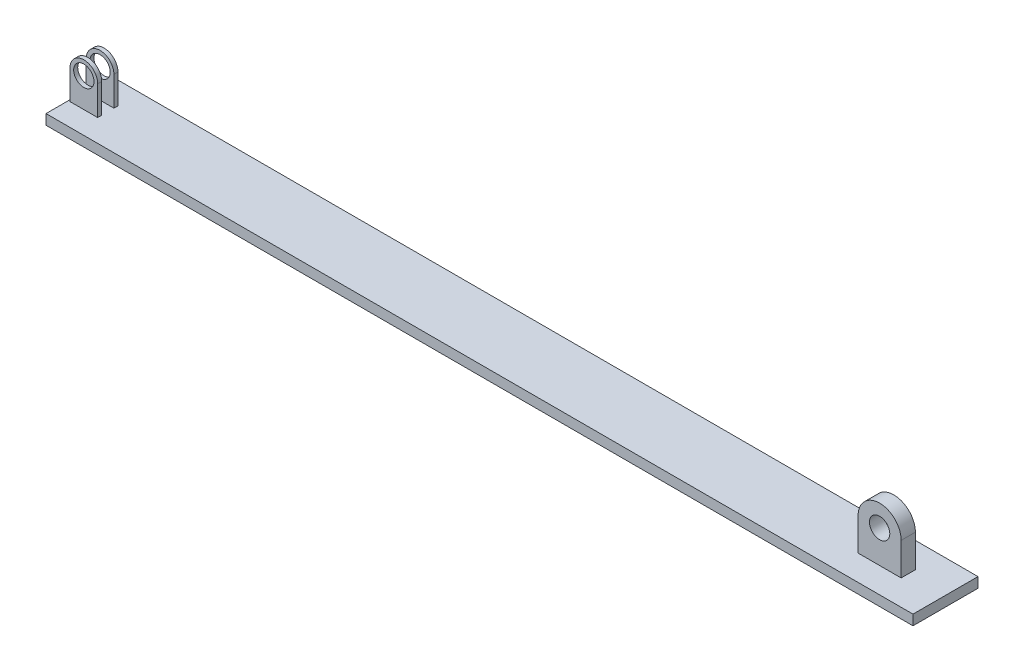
from build123d import *

# Parameters (mm, degrees)
SKETCH1_W          = 426.72
SKETCH1_H          = 5
EXTRUDE2_DEPTH     = 16
SKETCH2_R          = 5
EXTRUDE3_DEPTH     = 5
CUT_EXTRUDE1_REACH = 428.878
SKETCH3_W          = 6
SKETCH3_H          = 40.995425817
SKETCH4_R          = 5
EXTRUDE4_DEPTH     = 3.5


with BuildPart() as part:
    # Sketch1 → Extrude2 (new, symmetric)
    with BuildSketch(Plane(origin=(0, 0, 0), x_dir=(1, 0, 0), z_dir=(0, 0, -1))):
        with Locations((213.36, 0)):
            Rectangle(SKETCH1_W, SKETCH1_H)
    extrude(amount=EXTRUDE2_DEPTH, both=True)

    # Sketch2 → Extrude3 (add, symmetric)
    with BuildSketch(Plane.XY):
        with BuildLine():
            Line((0.803073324, 2.5), (0.803073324, 16.921503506))
            ThreePointArc((0.803073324, 16.921503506), (7.616482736, 23.734912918), (14.429892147, 16.921503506))
            Line((14.429892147, 16.921503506), (14.429892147, 2.5))
            Line((14.429892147, 2.5), (0.803073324, 2.5))
        make_face()
        with Locations((7.616482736, 16.921503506)):
            Circle(SKETCH2_R, mode=Mode.SUBTRACT)
    extrude(amount=EXTRUDE3_DEPTH, both=True)

    # Cut-Extrude1: up to this face of the body (flat: up to its plane)
    cut_extrude1_end = Plane(part.part.faces().sort_by_distance((14.429892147, 9.710751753, 0))[0])
    # Sketch3 → Cut-Extrude1 (cut, up to the picked face)
    with BuildSketch(Plane.ZY.offset(-0.803073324), mode=Mode.PRIVATE) as cut_extrude1_sk1:
        with Locations((0, 22.997712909)):
            Rectangle(SKETCH3_W, SKETCH3_H)
    cut_extrude1_tool1 = split(extrude(cut_extrude1_sk1.sketch, amount=-CUT_EXTRUDE1_REACH, mode=Mode.PRIVATE), bisect_by=cut_extrude1_end, keep=Keep.BOTH, mode=Mode.PRIVATE)
    add(cut_extrude1_tool1.solids().sort_by(Axis((0.803073, 22.997713, 0), (1, 0, 0)))[0], mode=Mode.SUBTRACT)

    # Sketch4 → Extrude4 (add, symmetric)
    with BuildSketch(Plane.XY):
        with BuildLine():
            Line((408.398633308, 2.5), (408.398633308, 18.51574669))
            ThreePointArc((408.398633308, 18.51574669), (397.805657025, 29.108722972), (387.212680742, 18.51574669))
            Line((387.212680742, 18.51574669), (387.212680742, 2.5))
            Line((387.212680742, 2.5), (408.398633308, 2.5))
        make_face()
        with Locations((397.805657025, 18.51574669)):
            Circle(SKETCH4_R, mode=Mode.SUBTRACT)
    extrude(amount=EXTRUDE4_DEPTH, both=True)


solid = part.part
